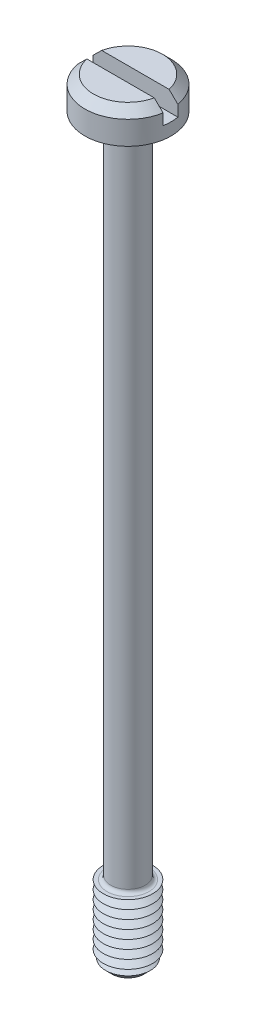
ISO-10303-21;
HEADER;
FILE_DESCRIPTION(('STEP AP214'),'2;1');
FILE_NAME('part.step','',(''),(''),'','','');
FILE_SCHEMA(('AUTOMOTIVE_DESIGN { 1 0 10303 214 1 1 1 1 }'));
ENDSEC;
DATA;
#1=APPLICATION_CONTEXT('core data for automotive mechanical design processes');
#2=APPLICATION_PROTOCOL_DEFINITION('international standard','automotive_design',2000,#1);
#3=PRODUCT_CONTEXT('',#1,'mechanical');
#4=PRODUCT('Part','Part','',(#3));
#5=PRODUCT_RELATED_PRODUCT_CATEGORY('part','',(#4));
#6=PRODUCT_DEFINITION_FORMATION('','',#4);
#7=PRODUCT_DEFINITION_CONTEXT('part definition',#1,'design');
#8=PRODUCT_DEFINITION('design','',#6,#7);
#9=PRODUCT_DEFINITION_SHAPE('','',#8);
#10=(LENGTH_UNIT() NAMED_UNIT(*) SI_UNIT(.MILLI.,.METRE.));
#11=(NAMED_UNIT(*) PLANE_ANGLE_UNIT() SI_UNIT($,.RADIAN.));
#12=(NAMED_UNIT(*) SI_UNIT($,.STERADIAN.) SOLID_ANGLE_UNIT());
#13=UNCERTAINTY_MEASURE_WITH_UNIT(LENGTH_MEASURE(1.E-05),#10,'distance_accuracy_value','');
#14=(GEOMETRIC_REPRESENTATION_CONTEXT(3) GLOBAL_UNCERTAINTY_ASSIGNED_CONTEXT((#13)) GLOBAL_UNIT_ASSIGNED_CONTEXT((#10,
#11,#12)) REPRESENTATION_CONTEXT('',''));
#15=CARTESIAN_POINT('',(0.,0.,0.));
#16=DIRECTION('',(0.,0.,1.));
#17=DIRECTION('',(1.,0.,0.));
#18=AXIS2_PLACEMENT_3D('',#15,#16,#17);
#19=CARTESIAN_POINT('',(0.,2.6,0.));
#20=DIRECTION('',(0.,1.,0.));
#21=DIRECTION('',(0.,0.,1.));
#22=AXIS2_PLACEMENT_3D('',#19,#20,#21);
#23=PLANE('',#22);
#24=DIRECTION('',(-1.,0.,0.));
#25=VECTOR('',#24,1.);
#26=CARTESIAN_POINT('',(3.5,2.6,-0.6));
#27=LINE('',#26,#25);
#28=CARTESIAN_POINT('',(2.73495886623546,2.6,-0.6));
#29=VERTEX_POINT('',#28);
#30=CARTESIAN_POINT('',(-2.73495886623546,2.6,-0.6));
#31=VERTEX_POINT('',#30);
#32=EDGE_CURVE('E110',#29,#31,#27,.T.);
#33=ORIENTED_EDGE('',*,*,#32,.F.);
#34=CARTESIAN_POINT('',(0.,2.6,0.));
#35=DIRECTION('',(0.,1.,0.));
#36=DIRECTION('',(0.,0.,1.));
#37=AXIS2_PLACEMENT_3D('',#34,#35,#36);
#38=CIRCLE('',#37,2.8);
#39=EDGE_CURVE('E113',#29,#31,#38,.T.);
#40=ORIENTED_EDGE('',*,*,#39,.T.);
#41=EDGE_LOOP('',(#33,#40));
#42=FACE_BOUND('',#41,.T.);
#43=ADVANCED_FACE('F39',(#42),#23,.T.);
#44=CARTESIAN_POINT('',(0.,2.6,0.));
#45=DIRECTION('',(0.,-1.,0.));
#46=DIRECTION('',(0.,0.,-1.));
#47=AXIS2_PLACEMENT_3D('',#44,#45,#46);
#48=CONICAL_SURFACE('',#47,2.8,0.785398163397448);
#49=CARTESIAN_POINT('',(7.69779986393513,-2.32114776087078,-0.6));
#50=CARTESIAN_POINT('',(7.42456340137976,-2.0487448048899,-0.6));
#51=CARTESIAN_POINT('',(7.15128998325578,-1.77637887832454,-0.6));
#52=CARTESIAN_POINT('',(6.60460779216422,-1.23176088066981,-0.6));
#53=CARTESIAN_POINT('',(6.33119901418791,-0.959508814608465,-0.6));
#54=CARTESIAN_POINT('',(5.78393918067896,-0.414914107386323,-0.6));
#55=CARTESIAN_POINT('',(5.51008795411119,-0.142571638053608,-0.6));
#56=CARTESIAN_POINT('',(4.96212493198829,0.401829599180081,-0.6));
#57=CARTESIAN_POINT('',(4.68801314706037,0.673888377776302,-0.6));
#58=CARTESIAN_POINT('',(4.15230810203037,1.20471714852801,-0.6));
#59=CARTESIAN_POINT('',(3.89073524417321,1.46350771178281,-0.6));
#60=CARTESIAN_POINT('',(3.49781694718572,1.85115830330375,-0.6));
#61=CARTESIAN_POINT('',(3.36674319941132,1.98029362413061,-0.6));
#62=CARTESIAN_POINT('',(3.10433907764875,2.23830030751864,-0.6));
#63=CARTESIAN_POINT('',(2.97300870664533,2.36717167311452,-0.6));
#64=CARTESIAN_POINT('',(2.71005235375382,2.62445652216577,-0.6));
#65=CARTESIAN_POINT('',(2.57842659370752,2.75287023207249,-0.6));
#66=CARTESIAN_POINT('',(2.31459302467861,3.00911021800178,-0.6));
#67=CARTESIAN_POINT('',(2.1823851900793,3.13693646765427,-0.6));
#68=CARTESIAN_POINT('',(1.91706128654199,3.39159289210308,-0.6));
#69=CARTESIAN_POINT('',(1.78394541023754,3.51842326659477,-0.6));
#70=CARTESIAN_POINT('',(1.5829745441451,3.70728046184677,-0.6));
#71=CARTESIAN_POINT('',(1.51577053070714,3.76999922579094,-0.6));
#72=CARTESIAN_POINT('',(1.38073587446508,3.89475766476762,-0.6));
#73=CARTESIAN_POINT('',(1.31290524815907,3.95679735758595,-0.6));
#74=CARTESIAN_POINT('',(1.20662362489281,4.05253127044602,-0.6));
#75=CARTESIAN_POINT('',(1.16849592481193,4.08658409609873,-0.6));
#76=CARTESIAN_POINT('',(1.09186306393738,4.15427097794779,-0.6));
#77=CARTESIAN_POINT('',(1.05335786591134,4.18790499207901,-0.6));
#78=CARTESIAN_POINT('',(0.975560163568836,4.25487029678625,-0.6));
#79=CARTESIAN_POINT('',(0.93626386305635,4.28819718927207,-0.6));
#80=CARTESIAN_POINT('',(0.857023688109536,4.3540539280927,-0.6));
#81=CARTESIAN_POINT('',(0.817079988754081,4.38658398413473,-0.6));
#82=CARTESIAN_POINT('',(0.73593206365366,4.45080389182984,-0.6));
#83=CARTESIAN_POINT('',(0.694719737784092,4.48248357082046,-0.6));
#84=CARTESIAN_POINT('',(0.611023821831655,4.54411116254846,-0.6));
#85=CARTESIAN_POINT('',(0.568540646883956,4.5740596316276,-0.6));
#86=CARTESIAN_POINT('',(0.482031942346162,4.63104137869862,-0.6));
#87=CARTESIAN_POINT('',(0.438018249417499,4.65809235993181,-0.6));
#88=CARTESIAN_POINT('',(0.347545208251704,4.70764477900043,-0.6));
#89=CARTESIAN_POINT('',(0.301093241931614,4.73015905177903,-0.6));
#90=CARTESIAN_POINT('',(0.216840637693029,4.76288589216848,-0.6));
#91=CARTESIAN_POINT('',(0.179711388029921,4.77476119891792,-0.6));
#92=CARTESIAN_POINT('',(0.104069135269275,4.79214056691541,-0.6));
#93=CARTESIAN_POINT('',(0.0655630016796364,4.79767265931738,-0.6));
#94=CARTESIAN_POINT('',(-0.0121083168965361,4.80113734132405,-0.6));
#95=CARTESIAN_POINT('',(-0.0512762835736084,4.7990121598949,-0.6));
#96=CARTESIAN_POINT('',(-0.128601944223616,4.78758103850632,-0.6));
#97=CARTESIAN_POINT('',(-0.166755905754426,4.77825158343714,-0.6));
#98=CARTESIAN_POINT('',(-0.239985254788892,4.75468984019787,-0.6));
#99=CARTESIAN_POINT('',(-0.275121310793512,4.74063623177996,-0.6));
#100=CARTESIAN_POINT('',(-0.343859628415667,4.70912771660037,-0.6));
#101=CARTESIAN_POINT('',(-0.377459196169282,4.6916670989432,-0.6));
#102=CARTESIAN_POINT('',(-0.443620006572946,4.65431398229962,-0.6));
#103=CARTESIAN_POINT('',(-0.476170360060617,4.63440256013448,-0.6));
#104=CARTESIAN_POINT('',(-0.540208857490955,4.59301144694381,-0.6));
#105=CARTESIAN_POINT('',(-0.57169782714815,4.57153301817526,-0.6));
#106=CARTESIAN_POINT('',(-0.636426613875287,4.52565712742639,-0.6));
#107=CARTESIAN_POINT('',(-0.669598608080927,4.50116466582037,-0.6));
#108=CARTESIAN_POINT('',(-0.735238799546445,4.45125092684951,-0.6));
#109=CARTESIAN_POINT('',(-0.767706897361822,4.42582951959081,-0.6));
#110=CARTESIAN_POINT('',(-0.864340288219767,4.3485376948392,-0.6));
#111=CARTESIAN_POINT('',(-0.927700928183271,4.29566444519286,-0.6));
#112=CARTESIAN_POINT('',(-1.05322030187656,4.18829389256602,-0.6));
#113=CARTESIAN_POINT('',(-1.11537654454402,4.1337937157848,-0.6));
#114=CARTESIAN_POINT('',(-1.23879800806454,4.02383276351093,-0.6));
#115=CARTESIAN_POINT('',(-1.30006349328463,3.96837228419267,-0.6));
#116=CARTESIAN_POINT('',(-1.42182653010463,3.85695373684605,-0.6));
#117=CARTESIAN_POINT('',(-1.48232573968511,3.80099747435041,-0.6));
#118=CARTESIAN_POINT('',(-1.602900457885,3.68862177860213,-0.6));
#119=CARTESIAN_POINT('',(-1.66297593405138,3.63220231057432,-0.6));
#120=CARTESIAN_POINT('',(-1.84259490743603,3.46258196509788,-0.6));
#121=CARTESIAN_POINT('',(-1.96167258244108,3.34888831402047,-0.6));
#122=CARTESIAN_POINT('',(-2.19942862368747,3.12043467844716,-0.6));
#123=CARTESIAN_POINT('',(-2.31810499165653,3.00567262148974,-0.6));
#124=CARTESIAN_POINT('',(-2.55498513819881,2.77566147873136,-0.6));
#125=CARTESIAN_POINT('',(-2.67318891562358,2.66041239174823,-0.6));
#126=CARTESIAN_POINT('',(-3.02733776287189,2.31418176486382,-0.6));
#127=CARTESIAN_POINT('',(-3.26281496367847,2.08272206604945,-0.6));
#128=CARTESIAN_POINT('',(-3.7332660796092,1.61902814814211,-0.6));
#129=CARTESIAN_POINT('',(-3.96823963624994,1.38679356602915,-0.6));
#130=CARTESIAN_POINT('',(-4.43780370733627,0.921942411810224,-0.6));
#131=CARTESIAN_POINT('',(-4.67239422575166,0.689325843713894,-0.6));
#132=CARTESIAN_POINT('',(-5.13982382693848,0.225350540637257,-0.6));
#133=CARTESIAN_POINT('',(-5.37266445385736,-0.00600663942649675,-0.6));
#134=CARTESIAN_POINT('',(-5.83818541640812,-0.468883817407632,-0.6));
#135=CARTESIAN_POINT('',(-6.07086575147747,-0.700403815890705,-0.6));
#136=CARTESIAN_POINT('',(-6.53596926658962,-1.16341429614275,-0.6));
#137=CARTESIAN_POINT('',(-6.76839251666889,-1.39490470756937,-0.6));
#138=CARTESIAN_POINT('',(-7.23315324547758,-1.85796986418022,-0.6));
#139=CARTESIAN_POINT('',(-7.46549072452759,-2.08954460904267,-0.6));
#140=CARTESIAN_POINT('',(-7.69779986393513,-2.32114776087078,-0.6));
#141=B_SPLINE_CURVE_WITH_KNOTS('',3,(#49,#50,#51,#52,#53,#54,#55,#56,#57,#58,#59,#60,#61,#62,
#63,#64,#65,#66,#67,#68,#69,#70,#71,#72,#73,#74,#75,#76,#77,#78,#79,#80,#81,#82,#83,#84,#85,#86,
#87,#88,#89,#90,#91,#92,#93,#94,#95,#96,#97,#98,#99,#100,#101,#102,#103,#104,#105,#106,#107,
#108,#109,#110,#111,#112,#113,#114,#115,#116,#117,#118,#119,#120,#121,#122,#123,#124,#125,#126,
#127,#128,#129,#130,#131,#132,#133,#134,#135,#136,#137,#138,#139,#140),.UNSPECIFIED.,.F.,.F.,(4,
2,2,2,2,2,2,2,2,2,2,2,2,2,2,2,2,2,2,2,2,2,2,2,2,2,2,2,2,2,2,2,2,2,2,2,2,2,2,2,2,2,2,2,2,4),(0.,
1.15747738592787,2.31500139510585,3.47365747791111,4.63226817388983,5.73614050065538,
6.28814234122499,6.84013779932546,7.39180548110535,7.94349768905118,8.49507629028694,
8.77084567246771,9.04660781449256,9.19996738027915,9.35334222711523,9.50791164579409,
9.66243993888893,9.81835637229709,9.9742224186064,10.1290741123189,10.2834813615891,
10.4000294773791,10.5160605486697,10.6329688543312,10.7502603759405,10.8635386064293,
10.9770083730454,11.0914168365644,11.205734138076,11.3294140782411,11.4531113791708,
11.7006314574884,11.9486181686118,12.1965297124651,12.4437540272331,12.6909970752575,
13.184904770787,13.6801705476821,14.1754375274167,15.1659939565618,16.1571087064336,
17.1482131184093,18.1329303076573,19.1176509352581,20.1017623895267,21.0858701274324),.UNSPECIFIED.);
#142=CARTESIAN_POINT('',(3.44818792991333,1.9,-0.6));
#143=VERTEX_POINT('',#142);
#144=EDGE_CURVE('E259',#143,#29,#141,.T.);
#145=ORIENTED_EDGE('',*,*,#144,.F.);
#146=CARTESIAN_POINT('',(0.,1.9,0.));
#147=DIRECTION('',(0.,1.,0.));
#148=DIRECTION('',(0.,0.,1.));
#149=AXIS2_PLACEMENT_3D('',#146,#147,#148);
#150=CIRCLE('',#149,3.5);
#151=CARTESIAN_POINT('',(-3.44818792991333,1.9,-0.6));
#152=VERTEX_POINT('',#151);
#153=EDGE_CURVE('E127',#152,#143,#150,.F.);
#154=ORIENTED_EDGE('',*,*,#153,.F.);
#155=EDGE_CURVE('E102',#31,#152,#141,.T.);
#156=ORIENTED_EDGE('',*,*,#155,.F.);
#157=ORIENTED_EDGE('',*,*,#39,.F.);
#158=EDGE_LOOP('',(#145,#154,#156,#157));
#159=FACE_BOUND('',#158,.T.);
#160=ADVANCED_FACE('F221',(#159),#48,.T.);
#161=CARTESIAN_POINT('',(0.,-60.,0.));
#162=DIRECTION('',(0.,1.,0.));
#163=DIRECTION('',(0.,0.,1.));
#164=AXIS2_PLACEMENT_3D('',#161,#162,#163);
#165=CYLINDRICAL_SURFACE('',#164,1.4);
#166=CARTESIAN_POINT('',(0.,-53.7,0.));
#167=DIRECTION('',(0.,-1.,0.));
#168=DIRECTION('',(0.,0.,-1.));
#169=AXIS2_PLACEMENT_3D('',#166,#167,#168);
#170=CIRCLE('',#169,1.4);
#171=CARTESIAN_POINT('',(0.,-53.7,-1.4));
#172=VERTEX_POINT('',#171);
#173=EDGE_CURVE('E122',#172,#172,#170,.F.);
#174=ORIENTED_EDGE('',*,*,#173,.T.);
#175=EDGE_LOOP('',(#174));
#176=FACE_BOUND('',#175,.T.);
#177=CARTESIAN_POINT('',(0.,-0.300000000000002,0.));
#178=DIRECTION('',(0.,1.,0.));
#179=DIRECTION('',(0.,0.,1.));
#180=AXIS2_PLACEMENT_3D('',#177,#178,#179);
#181=CIRCLE('',#180,1.4);
#182=CARTESIAN_POINT('',(0.,-0.300000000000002,1.4));
#183=VERTEX_POINT('',#182);
#184=EDGE_CURVE('E366',#183,#183,#181,.F.);
#185=ORIENTED_EDGE('',*,*,#184,.T.);
#186=EDGE_LOOP('',(#185));
#187=FACE_BOUND('',#186,.T.);
#188=ADVANCED_FACE('F217',(#176,#187),#165,.T.);
#189=CARTESIAN_POINT('',(0.,2.6,0.));
#190=DIRECTION('',(0.,-1.,0.));
#191=DIRECTION('',(0.,0.,-1.));
#192=AXIS2_PLACEMENT_3D('',#189,#190,#191);
#193=CYLINDRICAL_SURFACE('',#192,3.5);
#194=ORIENTED_EDGE('',*,*,#153,.T.);
#195=DIRECTION('',(0.,-1.,0.));
#196=VECTOR('',#195,1.);
#197=CARTESIAN_POINT('',(3.44818792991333,2.6,-0.6));
#198=LINE('',#197,#196);
#199=CARTESIAN_POINT('',(3.44818792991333,1.,-0.6));
#200=VERTEX_POINT('',#199);
#201=EDGE_CURVE('E64',#143,#200,#198,.T.);
#202=ORIENTED_EDGE('',*,*,#201,.T.);
#203=CARTESIAN_POINT('',(0.,1.,0.));
#204=DIRECTION('',(0.,1.,0.));
#205=DIRECTION('',(0.,0.,1.));
#206=AXIS2_PLACEMENT_3D('',#203,#204,#205);
#207=CIRCLE('',#206,3.5);
#208=CARTESIAN_POINT('',(3.44818792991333,1.,0.6));
#209=VERTEX_POINT('',#208);
#210=EDGE_CURVE('E11',#209,#200,#207,.T.);
#211=ORIENTED_EDGE('',*,*,#210,.F.);
#212=DIRECTION('',(0.,-1.,0.));
#213=VECTOR('',#212,1.);
#214=CARTESIAN_POINT('',(3.44818792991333,2.6,0.6));
#215=LINE('',#214,#213);
#216=CARTESIAN_POINT('',(3.44818792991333,1.9,0.6));
#217=VERTEX_POINT('',#216);
#218=EDGE_CURVE('E277',#209,#217,#215,.F.);
#219=ORIENTED_EDGE('',*,*,#218,.T.);
#220=CARTESIAN_POINT('',(-3.44818792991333,1.9,0.6));
#221=VERTEX_POINT('',#220);
#222=EDGE_CURVE('E119',#217,#221,#150,.F.);
#223=ORIENTED_EDGE('',*,*,#222,.T.);
#224=DIRECTION('',(0.,-1.,0.));
#225=VECTOR('',#224,1.);
#226=CARTESIAN_POINT('',(-3.44818792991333,2.6,0.6));
#227=LINE('',#226,#225);
#228=CARTESIAN_POINT('',(-3.44818792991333,1.,0.6));
#229=VERTEX_POINT('',#228);
#230=EDGE_CURVE('E96',#221,#229,#227,.T.);
#231=ORIENTED_EDGE('',*,*,#230,.T.);
#232=CARTESIAN_POINT('',(-3.44818792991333,1.,-0.6));
#233=VERTEX_POINT('',#232);
#234=EDGE_CURVE('E44',#233,#229,#207,.T.);
#235=ORIENTED_EDGE('',*,*,#234,.F.);
#236=DIRECTION('',(0.,-1.,0.));
#237=VECTOR('',#236,1.);
#238=CARTESIAN_POINT('',(-3.44818792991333,2.6,-0.6));
#239=LINE('',#238,#237);
#240=EDGE_CURVE('E281',#233,#152,#239,.F.);
#241=ORIENTED_EDGE('',*,*,#240,.T.);
#242=EDGE_LOOP('',(#194,#202,#211,#219,#223,#231,#235,#241));
#243=FACE_BOUND('',#242,.T.);
#244=CARTESIAN_POINT('',(0.,0.,0.));
#245=DIRECTION('',(0.,1.,0.));
#246=DIRECTION('',(0.,0.,1.));
#247=AXIS2_PLACEMENT_3D('',#244,#245,#246);
#248=CIRCLE('',#247,3.5);
#249=CARTESIAN_POINT('',(0.,0.,3.5));
#250=VERTEX_POINT('',#249);
#251=EDGE_CURVE('E352',#250,#250,#248,.T.);
#252=ORIENTED_EDGE('',*,*,#251,.T.);
#253=EDGE_LOOP('',(#252));
#254=FACE_BOUND('',#253,.T.);
#255=ADVANCED_FACE('F220',(#243,#254),#193,.T.);
#256=DIRECTION('',(1.,0.,0.));
#257=VECTOR('',#256,1.);
#258=CARTESIAN_POINT('',(3.5,2.6,0.6));
#259=LINE('',#258,#257);
#260=CARTESIAN_POINT('',(-2.73495886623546,2.6,0.6));
#261=VERTEX_POINT('',#260);
#262=CARTESIAN_POINT('',(2.73495886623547,2.6,0.6));
#263=VERTEX_POINT('',#262);
#264=EDGE_CURVE('E56',#261,#263,#259,.T.);
#265=ORIENTED_EDGE('',*,*,#264,.F.);
#266=EDGE_CURVE('E108',#261,#263,#38,.T.);
#267=ORIENTED_EDGE('',*,*,#266,.T.);
#268=EDGE_LOOP('',(#265,#267));
#269=FACE_BOUND('',#268,.T.);
#270=ADVANCED_FACE('F107',(#269),#23,.T.);
#271=CARTESIAN_POINT('',(0.,0.,0.));
#272=DIRECTION('',(0.,1.,0.));
#273=DIRECTION('',(0.,0.,1.));
#274=AXIS2_PLACEMENT_3D('',#271,#272,#273);
#275=PLANE('',#274);
#276=CARTESIAN_POINT('',(0.,0.,0.));
#277=DIRECTION('',(0.,1.,0.));
#278=DIRECTION('',(0.,0.,1.));
#279=AXIS2_PLACEMENT_3D('',#276,#277,#278);
#280=CIRCLE('',#279,1.7);
#281=CARTESIAN_POINT('',(0.,0.,1.7));
#282=VERTEX_POINT('',#281);
#283=EDGE_CURVE('E114',#282,#282,#280,.T.);
#284=ORIENTED_EDGE('',*,*,#283,.T.);
#285=EDGE_LOOP('',(#284));
#286=FACE_BOUND('',#285,.T.);
#287=ORIENTED_EDGE('',*,*,#251,.F.);
#288=EDGE_LOOP('',(#287));
#289=FACE_BOUND('',#288,.T.);
#290=ADVANCED_FACE('F211',(#286,#289),#275,.F.);
#291=CARTESIAN_POINT('',(0.,-54.,0.));
#292=DIRECTION('',(0.,-1.,0.));
#293=DIRECTION('',(0.,0.,-1.));
#294=AXIS2_PLACEMENT_3D('',#291,#292,#293);
#295=PLANE('',#294);
#296=CARTESIAN_POINT('',(0.,-54.,0.));
#297=DIRECTION('',(0.,-1.,0.));
#298=DIRECTION('',(0.,0.,-1.));
#299=AXIS2_PLACEMENT_3D('',#296,#297,#298);
#300=CIRCLE('',#299,1.7);
#301=CARTESIAN_POINT('',(0.,-54.,-1.7));
#302=VERTEX_POINT('',#301);
#303=EDGE_CURVE('E360',#302,#302,#300,.T.);
#304=ORIENTED_EDGE('',*,*,#303,.T.);
#305=EDGE_LOOP('',(#304));
#306=FACE_BOUND('',#305,.T.);
#307=CARTESIAN_POINT('',(0.,-54.,0.));
#308=DIRECTION('',(0.,1.,0.));
#309=DIRECTION('',(0.,0.,1.));
#310=AXIS2_PLACEMENT_3D('',#307,#308,#309);
#311=CIRCLE('',#310,2.);
#312=CARTESIAN_POINT('',(0.,-54.,2.));
#313=VERTEX_POINT('',#312);
#314=EDGE_CURVE('E348',#313,#313,#311,.T.);
#315=ORIENTED_EDGE('',*,*,#314,.T.);
#316=EDGE_LOOP('',(#315));
#317=FACE_BOUND('',#316,.T.);
#318=ADVANCED_FACE('F207',(#306,#317),#295,.F.);
#319=CARTESIAN_POINT('',(0.,-54.35,0.));
#320=DIRECTION('',(0.,1.,0.));
#321=DIRECTION('',(0.,0.,1.));
#322=AXIS2_PLACEMENT_3D('',#319,#320,#321);
#323=CONICAL_SURFACE('',#322,1.39378221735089,1.0471975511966);
#324=ORIENTED_EDGE('',*,*,#314,.F.);
#325=EDGE_LOOP('',(#324));
#326=FACE_BOUND('',#325,.T.);
#327=CARTESIAN_POINT('',(0.,-54.35,0.));
#328=DIRECTION('',(0.,1.,0.));
#329=DIRECTION('',(0.,0.,1.));
#330=AXIS2_PLACEMENT_3D('',#327,#328,#329);
#331=CIRCLE('',#330,1.39378221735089);
#332=CARTESIAN_POINT('',(0.,-54.35,1.39378221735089));
#333=VERTEX_POINT('',#332);
#334=EDGE_CURVE('E345',#333,#333,#331,.T.);
#335=ORIENTED_EDGE('',*,*,#334,.T.);
#336=EDGE_LOOP('',(#335));
#337=FACE_BOUND('',#336,.T.);
#338=ADVANCED_FACE('F203',(#326,#337),#323,.T.);
#339=CARTESIAN_POINT('',(0.,-54.7,0.));
#340=DIRECTION('',(0.,-1.,0.));
#341=DIRECTION('',(0.,0.,-1.));
#342=AXIS2_PLACEMENT_3D('',#339,#340,#341);
#343=CONICAL_SURFACE('',#342,2.,1.04719755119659);
#344=ORIENTED_EDGE('',*,*,#334,.F.);
#345=EDGE_LOOP('',(#344));
#346=FACE_BOUND('',#345,.T.);
#347=CARTESIAN_POINT('',(0.,-54.7,0.));
#348=DIRECTION('',(0.,1.,0.));
#349=DIRECTION('',(0.,0.,1.));
#350=AXIS2_PLACEMENT_3D('',#347,#348,#349);
#351=CIRCLE('',#350,2.);
#352=CARTESIAN_POINT('',(0.,-54.7,2.));
#353=VERTEX_POINT('',#352);
#354=EDGE_CURVE('E341',#353,#353,#351,.T.);
#355=ORIENTED_EDGE('',*,*,#354,.T.);
#356=EDGE_LOOP('',(#355));
#357=FACE_BOUND('',#356,.T.);
#358=ADVANCED_FACE('F199',(#346,#357),#343,.T.);
#359=CARTESIAN_POINT('',(0.,-55.05,0.));
#360=DIRECTION('',(0.,1.,0.));
#361=DIRECTION('',(0.,0.,1.));
#362=AXIS2_PLACEMENT_3D('',#359,#360,#361);
#363=CONICAL_SURFACE('',#362,1.39378221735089,1.0471975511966);
#364=ORIENTED_EDGE('',*,*,#354,.F.);
#365=EDGE_LOOP('',(#364));
#366=FACE_BOUND('',#365,.T.);
#367=CARTESIAN_POINT('',(0.,-55.05,0.));
#368=DIRECTION('',(0.,1.,0.));
#369=DIRECTION('',(0.,0.,1.));
#370=AXIS2_PLACEMENT_3D('',#367,#368,#369);
#371=CIRCLE('',#370,1.39378221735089);
#372=CARTESIAN_POINT('',(0.,-55.05,1.39378221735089));
#373=VERTEX_POINT('',#372);
#374=EDGE_CURVE('E337',#373,#373,#371,.T.);
#375=ORIENTED_EDGE('',*,*,#374,.T.);
#376=EDGE_LOOP('',(#375));
#377=FACE_BOUND('',#376,.T.);
#378=ADVANCED_FACE('F195',(#366,#377),#363,.T.);
#379=CARTESIAN_POINT('',(0.,-55.4,0.));
#380=DIRECTION('',(0.,-1.,0.));
#381=DIRECTION('',(0.,0.,-1.));
#382=AXIS2_PLACEMENT_3D('',#379,#380,#381);
#383=CONICAL_SURFACE('',#382,2.,1.04719755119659);
#384=ORIENTED_EDGE('',*,*,#374,.F.);
#385=EDGE_LOOP('',(#384));
#386=FACE_BOUND('',#385,.T.);
#387=CARTESIAN_POINT('',(0.,-55.4,0.));
#388=DIRECTION('',(0.,1.,0.));
#389=DIRECTION('',(0.,0.,1.));
#390=AXIS2_PLACEMENT_3D('',#387,#388,#389);
#391=CIRCLE('',#390,2.);
#392=CARTESIAN_POINT('',(0.,-55.4,2.));
#393=VERTEX_POINT('',#392);
#394=EDGE_CURVE('E333',#393,#393,#391,.T.);
#395=ORIENTED_EDGE('',*,*,#394,.T.);
#396=EDGE_LOOP('',(#395));
#397=FACE_BOUND('',#396,.T.);
#398=ADVANCED_FACE('F191',(#386,#397),#383,.T.);
#399=CARTESIAN_POINT('',(0.,-55.75,0.));
#400=DIRECTION('',(0.,1.,0.));
#401=DIRECTION('',(0.,0.,1.));
#402=AXIS2_PLACEMENT_3D('',#399,#400,#401);
#403=CONICAL_SURFACE('',#402,1.39378221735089,1.0471975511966);
#404=ORIENTED_EDGE('',*,*,#394,.F.);
#405=EDGE_LOOP('',(#404));
#406=FACE_BOUND('',#405,.T.);
#407=CARTESIAN_POINT('',(0.,-55.75,0.));
#408=DIRECTION('',(0.,1.,0.));
#409=DIRECTION('',(0.,0.,1.));
#410=AXIS2_PLACEMENT_3D('',#407,#408,#409);
#411=CIRCLE('',#410,1.39378221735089);
#412=CARTESIAN_POINT('',(0.,-55.75,1.39378221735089));
#413=VERTEX_POINT('',#412);
#414=EDGE_CURVE('E329',#413,#413,#411,.T.);
#415=ORIENTED_EDGE('',*,*,#414,.T.);
#416=EDGE_LOOP('',(#415));
#417=FACE_BOUND('',#416,.T.);
#418=ADVANCED_FACE('F187',(#406,#417),#403,.T.);
#419=CARTESIAN_POINT('',(0.,-56.1,0.));
#420=DIRECTION('',(0.,-1.,0.));
#421=DIRECTION('',(0.,0.,-1.));
#422=AXIS2_PLACEMENT_3D('',#419,#420,#421);
#423=CONICAL_SURFACE('',#422,2.,1.04719755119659);
#424=ORIENTED_EDGE('',*,*,#414,.F.);
#425=EDGE_LOOP('',(#424));
#426=FACE_BOUND('',#425,.T.);
#427=CARTESIAN_POINT('',(0.,-56.1,0.));
#428=DIRECTION('',(0.,1.,0.));
#429=DIRECTION('',(0.,0.,1.));
#430=AXIS2_PLACEMENT_3D('',#427,#428,#429);
#431=CIRCLE('',#430,2.);
#432=CARTESIAN_POINT('',(0.,-56.1,2.));
#433=VERTEX_POINT('',#432);
#434=EDGE_CURVE('E326',#433,#433,#431,.T.);
#435=ORIENTED_EDGE('',*,*,#434,.T.);
#436=EDGE_LOOP('',(#435));
#437=FACE_BOUND('',#436,.T.);
#438=ADVANCED_FACE('F183',(#426,#437),#423,.T.);
#439=CARTESIAN_POINT('',(0.,-56.45,0.));
#440=DIRECTION('',(0.,1.,0.));
#441=DIRECTION('',(0.,0.,1.));
#442=AXIS2_PLACEMENT_3D('',#439,#440,#441);
#443=CONICAL_SURFACE('',#442,1.39378221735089,1.0471975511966);
#444=ORIENTED_EDGE('',*,*,#434,.F.);
#445=EDGE_LOOP('',(#444));
#446=FACE_BOUND('',#445,.T.);
#447=CARTESIAN_POINT('',(0.,-56.45,0.));
#448=DIRECTION('',(0.,1.,0.));
#449=DIRECTION('',(0.,0.,1.));
#450=AXIS2_PLACEMENT_3D('',#447,#448,#449);
#451=CIRCLE('',#450,1.39378221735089);
#452=CARTESIAN_POINT('',(0.,-56.45,1.39378221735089));
#453=VERTEX_POINT('',#452);
#454=EDGE_CURVE('E323',#453,#453,#451,.T.);
#455=ORIENTED_EDGE('',*,*,#454,.T.);
#456=EDGE_LOOP('',(#455));
#457=FACE_BOUND('',#456,.T.);
#458=ADVANCED_FACE('F179',(#446,#457),#443,.T.);
#459=CARTESIAN_POINT('',(0.,-56.8,0.));
#460=DIRECTION('',(0.,-1.,0.));
#461=DIRECTION('',(0.,0.,-1.));
#462=AXIS2_PLACEMENT_3D('',#459,#460,#461);
#463=CONICAL_SURFACE('',#462,2.,1.04719755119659);
#464=ORIENTED_EDGE('',*,*,#454,.F.);
#465=EDGE_LOOP('',(#464));
#466=FACE_BOUND('',#465,.T.);
#467=CARTESIAN_POINT('',(0.,-56.8,0.));
#468=DIRECTION('',(0.,1.,0.));
#469=DIRECTION('',(0.,0.,1.));
#470=AXIS2_PLACEMENT_3D('',#467,#468,#469);
#471=CIRCLE('',#470,2.);
#472=CARTESIAN_POINT('',(0.,-56.8,2.));
#473=VERTEX_POINT('',#472);
#474=EDGE_CURVE('E319',#473,#473,#471,.T.);
#475=ORIENTED_EDGE('',*,*,#474,.T.);
#476=EDGE_LOOP('',(#475));
#477=FACE_BOUND('',#476,.T.);
#478=ADVANCED_FACE('F175',(#466,#477),#463,.T.);
#479=CARTESIAN_POINT('',(0.,-57.15,0.));
#480=DIRECTION('',(0.,1.,0.));
#481=DIRECTION('',(0.,0.,1.));
#482=AXIS2_PLACEMENT_3D('',#479,#480,#481);
#483=CONICAL_SURFACE('',#482,1.39378221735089,1.0471975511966);
#484=ORIENTED_EDGE('',*,*,#474,.F.);
#485=EDGE_LOOP('',(#484));
#486=FACE_BOUND('',#485,.T.);
#487=CARTESIAN_POINT('',(0.,-57.15,0.));
#488=DIRECTION('',(0.,1.,0.));
#489=DIRECTION('',(0.,0.,1.));
#490=AXIS2_PLACEMENT_3D('',#487,#488,#489);
#491=CIRCLE('',#490,1.39378221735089);
#492=CARTESIAN_POINT('',(0.,-57.15,1.39378221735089));
#493=VERTEX_POINT('',#492);
#494=EDGE_CURVE('E315',#493,#493,#491,.T.);
#495=ORIENTED_EDGE('',*,*,#494,.T.);
#496=EDGE_LOOP('',(#495));
#497=FACE_BOUND('',#496,.T.);
#498=ADVANCED_FACE('F171',(#486,#497),#483,.T.);
#499=CARTESIAN_POINT('',(0.,-57.5,0.));
#500=DIRECTION('',(0.,-1.,0.));
#501=DIRECTION('',(0.,0.,-1.));
#502=AXIS2_PLACEMENT_3D('',#499,#500,#501);
#503=CONICAL_SURFACE('',#502,2.,1.04719755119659);
#504=ORIENTED_EDGE('',*,*,#494,.F.);
#505=EDGE_LOOP('',(#504));
#506=FACE_BOUND('',#505,.T.);
#507=CARTESIAN_POINT('',(0.,-57.5,0.));
#508=DIRECTION('',(0.,1.,0.));
#509=DIRECTION('',(0.,0.,1.));
#510=AXIS2_PLACEMENT_3D('',#507,#508,#509);
#511=CIRCLE('',#510,2.);
#512=CARTESIAN_POINT('',(0.,-57.5,2.));
#513=VERTEX_POINT('',#512);
#514=EDGE_CURVE('E311',#513,#513,#511,.T.);
#515=ORIENTED_EDGE('',*,*,#514,.T.);
#516=EDGE_LOOP('',(#515));
#517=FACE_BOUND('',#516,.T.);
#518=ADVANCED_FACE('F167',(#506,#517),#503,.T.);
#519=CARTESIAN_POINT('',(0.,-57.85,0.));
#520=DIRECTION('',(0.,1.,0.));
#521=DIRECTION('',(0.,0.,1.));
#522=AXIS2_PLACEMENT_3D('',#519,#520,#521);
#523=CONICAL_SURFACE('',#522,1.39378221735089,1.0471975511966);
#524=ORIENTED_EDGE('',*,*,#514,.F.);
#525=EDGE_LOOP('',(#524));
#526=FACE_BOUND('',#525,.T.);
#527=CARTESIAN_POINT('',(0.,-57.85,0.));
#528=DIRECTION('',(0.,1.,0.));
#529=DIRECTION('',(0.,0.,1.));
#530=AXIS2_PLACEMENT_3D('',#527,#528,#529);
#531=CIRCLE('',#530,1.39378221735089);
#532=CARTESIAN_POINT('',(0.,-57.85,1.39378221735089));
#533=VERTEX_POINT('',#532);
#534=EDGE_CURVE('E307',#533,#533,#531,.T.);
#535=ORIENTED_EDGE('',*,*,#534,.T.);
#536=EDGE_LOOP('',(#535));
#537=FACE_BOUND('',#536,.T.);
#538=ADVANCED_FACE('F163',(#526,#537),#523,.T.);
#539=CARTESIAN_POINT('',(0.,-58.2,0.));
#540=DIRECTION('',(0.,-1.,0.));
#541=DIRECTION('',(0.,0.,-1.));
#542=AXIS2_PLACEMENT_3D('',#539,#540,#541);
#543=CONICAL_SURFACE('',#542,2.,1.04719755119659);
#544=ORIENTED_EDGE('',*,*,#534,.F.);
#545=EDGE_LOOP('',(#544));
#546=FACE_BOUND('',#545,.T.);
#547=CARTESIAN_POINT('',(0.,-58.2,0.));
#548=DIRECTION('',(0.,1.,0.));
#549=DIRECTION('',(0.,0.,1.));
#550=AXIS2_PLACEMENT_3D('',#547,#548,#549);
#551=CIRCLE('',#550,2.);
#552=CARTESIAN_POINT('',(0.,-58.2,2.));
#553=VERTEX_POINT('',#552);
#554=EDGE_CURVE('E303',#553,#553,#551,.T.);
#555=ORIENTED_EDGE('',*,*,#554,.T.);
#556=EDGE_LOOP('',(#555));
#557=FACE_BOUND('',#556,.T.);
#558=ADVANCED_FACE('F159',(#546,#557),#543,.T.);
#559=CARTESIAN_POINT('',(0.,-58.55,0.));
#560=DIRECTION('',(0.,1.,0.));
#561=DIRECTION('',(0.,0.,1.));
#562=AXIS2_PLACEMENT_3D('',#559,#560,#561);
#563=CONICAL_SURFACE('',#562,1.39378221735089,1.0471975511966);
#564=ORIENTED_EDGE('',*,*,#554,.F.);
#565=EDGE_LOOP('',(#564));
#566=FACE_BOUND('',#565,.T.);
#567=CARTESIAN_POINT('',(0.,-58.55,0.));
#568=DIRECTION('',(0.,1.,0.));
#569=DIRECTION('',(0.,0.,1.));
#570=AXIS2_PLACEMENT_3D('',#567,#568,#569);
#571=CIRCLE('',#570,1.39378221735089);
#572=CARTESIAN_POINT('',(0.,-58.55,1.39378221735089));
#573=VERTEX_POINT('',#572);
#574=EDGE_CURVE('E300',#573,#573,#571,.T.);
#575=ORIENTED_EDGE('',*,*,#574,.T.);
#576=EDGE_LOOP('',(#575));
#577=FACE_BOUND('',#576,.T.);
#578=ADVANCED_FACE('F155',(#566,#577),#563,.T.);
#579=CARTESIAN_POINT('',(0.,-58.9,0.));
#580=DIRECTION('',(0.,-1.,0.));
#581=DIRECTION('',(0.,0.,-1.));
#582=AXIS2_PLACEMENT_3D('',#579,#580,#581);
#583=CONICAL_SURFACE('',#582,2.,1.04719755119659);
#584=ORIENTED_EDGE('',*,*,#574,.F.);
#585=EDGE_LOOP('',(#584));
#586=FACE_BOUND('',#585,.T.);
#587=CARTESIAN_POINT('',(0.,-58.9,0.));
#588=DIRECTION('',(0.,1.,0.));
#589=DIRECTION('',(0.,0.,1.));
#590=AXIS2_PLACEMENT_3D('',#587,#588,#589);
#591=CIRCLE('',#590,2.);
#592=CARTESIAN_POINT('',(0.,-58.9,2.));
#593=VERTEX_POINT('',#592);
#594=EDGE_CURVE('E296',#593,#593,#591,.T.);
#595=ORIENTED_EDGE('',*,*,#594,.T.);
#596=EDGE_LOOP('',(#595));
#597=FACE_BOUND('',#596,.T.);
#598=ADVANCED_FACE('F151',(#586,#597),#583,.T.);
#599=CARTESIAN_POINT('',(0.,-59.25,0.));
#600=DIRECTION('',(0.,1.,0.));
#601=DIRECTION('',(0.,0.,1.));
#602=AXIS2_PLACEMENT_3D('',#599,#600,#601);
#603=CONICAL_SURFACE('',#602,1.39378221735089,1.0471975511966);
#604=ORIENTED_EDGE('',*,*,#594,.F.);
#605=EDGE_LOOP('',(#604));
#606=FACE_BOUND('',#605,.T.);
#607=CARTESIAN_POINT('',(0.,-59.25,0.));
#608=DIRECTION('',(0.,1.,0.));
#609=DIRECTION('',(0.,0.,1.));
#610=AXIS2_PLACEMENT_3D('',#607,#608,#609);
#611=CIRCLE('',#610,1.39378221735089);
#612=CARTESIAN_POINT('',(0.,-59.25,1.39378221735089));
#613=VERTEX_POINT('',#612);
#614=EDGE_CURVE('E292',#613,#613,#611,.T.);
#615=ORIENTED_EDGE('',*,*,#614,.T.);
#616=EDGE_LOOP('',(#615));
#617=FACE_BOUND('',#616,.T.);
#618=ADVANCED_FACE('F147',(#606,#617),#603,.T.);
#619=CARTESIAN_POINT('',(0.,-59.6,0.));
#620=DIRECTION('',(0.,-1.,0.));
#621=DIRECTION('',(0.,0.,-1.));
#622=AXIS2_PLACEMENT_3D('',#619,#620,#621);
#623=CONICAL_SURFACE('',#622,2.,1.04719755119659);
#624=CARTESIAN_POINT('',(0.,-59.4901923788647,0.));
#625=DIRECTION('',(0.,-1.,0.));
#626=DIRECTION('',(0.,0.,-1.));
#627=AXIS2_PLACEMENT_3D('',#624,#625,#626);
#628=CIRCLE('',#627,1.80980762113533);
#629=CARTESIAN_POINT('',(0.,-59.4901923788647,-1.80980762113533));
#630=VERTEX_POINT('',#629);
#631=EDGE_CURVE('E299',#630,#630,#628,.F.);
#632=ORIENTED_EDGE('',*,*,#631,.T.);
#633=EDGE_LOOP('',(#632));
#634=FACE_BOUND('',#633,.T.);
#635=ORIENTED_EDGE('',*,*,#614,.F.);
#636=EDGE_LOOP('',(#635));
#637=FACE_BOUND('',#636,.T.);
#638=ADVANCED_FACE('F143',(#634,#637),#623,.T.);
#639=CARTESIAN_POINT('',(0.,-60.,0.));
#640=DIRECTION('',(0.,-1.,0.));
#641=DIRECTION('',(0.,0.,-1.));
#642=AXIS2_PLACEMENT_3D('',#639,#640,#641);
#643=PLANE('',#642);
#644=CARTESIAN_POINT('',(0.,-60.,0.));
#645=DIRECTION('',(0.,-1.,0.));
#646=DIRECTION('',(0.,0.,-1.));
#647=AXIS2_PLACEMENT_3D('',#644,#645,#646);
#648=CIRCLE('',#647,1.3);
#649=CARTESIAN_POINT('',(0.,-60.,-1.3));
#650=VERTEX_POINT('',#649);
#651=EDGE_CURVE('E356',#650,#650,#648,.T.);
#652=ORIENTED_EDGE('',*,*,#651,.T.);
#653=EDGE_LOOP('',(#652));
#654=FACE_BOUND('',#653,.T.);
#655=ADVANCED_FACE('F146',(#654),#643,.T.);
#656=CARTESIAN_POINT('',(0.,-60.,0.));
#657=DIRECTION('',(0.,1.,0.));
#658=DIRECTION('',(0.,0.,1.));
#659=AXIS2_PLACEMENT_3D('',#656,#657,#658);
#660=CONICAL_SURFACE('',#659,1.3,0.785398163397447);
#661=ORIENTED_EDGE('',*,*,#631,.F.);
#662=EDGE_LOOP('',(#661));
#663=FACE_BOUND('',#662,.T.);
#664=ORIENTED_EDGE('',*,*,#651,.F.);
#665=EDGE_LOOP('',(#664));
#666=FACE_BOUND('',#665,.T.);
#667=ADVANCED_FACE('F215',(#663,#666),#660,.T.);
#668=CARTESIAN_POINT('',(0.,-53.7,0.));
#669=DIRECTION('',(0.,-1.,0.));
#670=DIRECTION('',(0.,0.,-1.));
#671=AXIS2_PLACEMENT_3D('',#668,#669,#670);
#672=TOROIDAL_SURFACE('',#671,1.7,0.3);
#673=ORIENTED_EDGE('',*,*,#173,.F.);
#674=EDGE_LOOP('',(#673));
#675=FACE_BOUND('',#674,.T.);
#676=ORIENTED_EDGE('',*,*,#303,.F.);
#677=EDGE_LOOP('',(#676));
#678=FACE_BOUND('',#677,.T.);
#679=ADVANCED_FACE('F233',(#675,#678),#672,.F.);
#680=CARTESIAN_POINT('',(0.,-0.300000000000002,0.));
#681=DIRECTION('',(0.,1.,0.));
#682=DIRECTION('',(0.,0.,1.));
#683=AXIS2_PLACEMENT_3D('',#680,#681,#682);
#684=TOROIDAL_SURFACE('',#683,1.7,0.3);
#685=ORIENTED_EDGE('',*,*,#283,.F.);
#686=EDGE_LOOP('',(#685));
#687=FACE_BOUND('',#686,.T.);
#688=ORIENTED_EDGE('',*,*,#184,.F.);
#689=EDGE_LOOP('',(#688));
#690=FACE_BOUND('',#689,.T.);
#691=ADVANCED_FACE('F236',(#687,#690),#684,.F.);
#692=CARTESIAN_POINT('',(-7.69779986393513,-2.32114776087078,0.6));
#693=CARTESIAN_POINT('',(-7.42456340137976,-2.0487448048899,0.6));
#694=CARTESIAN_POINT('',(-7.15128998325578,-1.77637887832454,0.6));
#695=CARTESIAN_POINT('',(-6.60460779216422,-1.23176088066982,0.6));
#696=CARTESIAN_POINT('',(-6.33119901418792,-0.959508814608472,0.6));
#697=CARTESIAN_POINT('',(-5.78393918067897,-0.414914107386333,0.6));
#698=CARTESIAN_POINT('',(-5.5100879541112,-0.14257163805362,0.6));
#699=CARTESIAN_POINT('',(-4.96212493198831,0.401829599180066,0.6));
#700=CARTESIAN_POINT('',(-4.68801314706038,0.673888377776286,0.6));
#701=CARTESIAN_POINT('',(-4.15230810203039,1.20471714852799,0.6));
#702=CARTESIAN_POINT('',(-3.89073524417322,1.4635077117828,0.6));
#703=CARTESIAN_POINT('',(-3.49781694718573,1.85115830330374,0.6));
#704=CARTESIAN_POINT('',(-3.36674319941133,1.9802936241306,0.6));
#705=CARTESIAN_POINT('',(-3.10433907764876,2.23830030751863,0.6));
#706=CARTESIAN_POINT('',(-2.97300870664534,2.36717167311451,0.6));
#707=CARTESIAN_POINT('',(-2.71005235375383,2.62445652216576,0.6));
#708=CARTESIAN_POINT('',(-2.57842659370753,2.75287023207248,0.6));
#709=CARTESIAN_POINT('',(-2.31459302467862,3.00911021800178,0.6));
#710=CARTESIAN_POINT('',(-2.1823851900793,3.13693646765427,0.6));
#711=CARTESIAN_POINT('',(-1.91706128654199,3.39159289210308,0.6));
#712=CARTESIAN_POINT('',(-1.78394541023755,3.51842326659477,0.6));
#713=CARTESIAN_POINT('',(-1.5829745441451,3.70728046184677,0.6));
#714=CARTESIAN_POINT('',(-1.51577053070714,3.76999922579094,0.6));
#715=CARTESIAN_POINT('',(-1.38073587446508,3.89475766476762,0.6));
#716=CARTESIAN_POINT('',(-1.31290524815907,3.95679735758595,0.6));
#717=CARTESIAN_POINT('',(-1.20662362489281,4.05253127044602,0.6));
#718=CARTESIAN_POINT('',(-1.16849592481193,4.08658409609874,0.6));
#719=CARTESIAN_POINT('',(-1.09186306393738,4.15427097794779,0.6));
#720=CARTESIAN_POINT('',(-1.05335786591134,4.18790499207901,0.6));
#721=CARTESIAN_POINT('',(-0.975560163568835,4.25487029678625,0.6));
#722=CARTESIAN_POINT('',(-0.936263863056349,4.28819718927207,0.6));
#723=CARTESIAN_POINT('',(-0.857023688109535,4.3540539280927,0.6));
#724=CARTESIAN_POINT('',(-0.81707998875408,4.38658398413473,0.6));
#725=CARTESIAN_POINT('',(-0.735932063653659,4.45080389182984,0.6));
#726=CARTESIAN_POINT('',(-0.694719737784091,4.48248357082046,0.6));
#727=CARTESIAN_POINT('',(-0.611023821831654,4.54411116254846,0.6));
#728=CARTESIAN_POINT('',(-0.568540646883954,4.5740596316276,0.6));
#729=CARTESIAN_POINT('',(-0.482031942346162,4.63104137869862,0.6));
#730=CARTESIAN_POINT('',(-0.438018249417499,4.65809235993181,0.6));
#731=CARTESIAN_POINT('',(-0.347545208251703,4.70764477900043,0.6));
#732=CARTESIAN_POINT('',(-0.301093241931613,4.73015905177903,0.6));
#733=CARTESIAN_POINT('',(-0.216840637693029,4.76288589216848,0.6));
#734=CARTESIAN_POINT('',(-0.179711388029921,4.77476119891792,0.6));
#735=CARTESIAN_POINT('',(-0.104069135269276,4.79214056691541,0.6));
#736=CARTESIAN_POINT('',(-0.0655630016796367,4.79767265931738,0.6));
#737=CARTESIAN_POINT('',(0.0121083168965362,4.80113734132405,0.6));
#738=CARTESIAN_POINT('',(0.0512762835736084,4.7990121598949,0.6));
#739=CARTESIAN_POINT('',(0.128601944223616,4.78758103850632,0.6));
#740=CARTESIAN_POINT('',(0.166755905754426,4.77825158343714,0.6));
#741=CARTESIAN_POINT('',(0.239985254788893,4.75468984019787,0.6));
#742=CARTESIAN_POINT('',(0.275121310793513,4.74063623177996,0.6));
#743=CARTESIAN_POINT('',(0.343859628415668,4.70912771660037,0.6));
#744=CARTESIAN_POINT('',(0.377459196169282,4.6916670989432,0.6));
#745=CARTESIAN_POINT('',(0.443620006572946,4.65431398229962,0.6));
#746=CARTESIAN_POINT('',(0.476170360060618,4.63440256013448,0.6));
#747=CARTESIAN_POINT('',(0.540208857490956,4.59301144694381,0.6));
#748=CARTESIAN_POINT('',(0.571697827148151,4.57153301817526,0.6));
#749=CARTESIAN_POINT('',(0.636426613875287,4.52565712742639,0.6));
#750=CARTESIAN_POINT('',(0.669598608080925,4.50116466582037,0.6));
#751=CARTESIAN_POINT('',(0.735238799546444,4.45125092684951,0.6));
#752=CARTESIAN_POINT('',(0.767706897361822,4.42582951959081,0.6));
#753=CARTESIAN_POINT('',(0.864340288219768,4.3485376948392,0.6));
#754=CARTESIAN_POINT('',(0.927700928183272,4.29566444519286,0.6));
#755=CARTESIAN_POINT('',(1.05322030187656,4.18829389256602,0.6));
#756=CARTESIAN_POINT('',(1.11537654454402,4.1337937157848,0.6));
#757=CARTESIAN_POINT('',(1.23879800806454,4.02383276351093,0.6));
#758=CARTESIAN_POINT('',(1.30006349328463,3.96837228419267,0.6));
#759=CARTESIAN_POINT('',(1.42182653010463,3.85695373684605,0.6));
#760=CARTESIAN_POINT('',(1.48232573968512,3.80099747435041,0.6));
#761=CARTESIAN_POINT('',(1.602900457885,3.68862177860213,0.6));
#762=CARTESIAN_POINT('',(1.66297593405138,3.63220231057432,0.6));
#763=CARTESIAN_POINT('',(1.84259490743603,3.46258196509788,0.6));
#764=CARTESIAN_POINT('',(1.96167258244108,3.34888831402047,0.6));
#765=CARTESIAN_POINT('',(2.19942862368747,3.12043467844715,0.6));
#766=CARTESIAN_POINT('',(2.31810499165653,3.00567262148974,0.6));
#767=CARTESIAN_POINT('',(2.55498513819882,2.77566147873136,0.6));
#768=CARTESIAN_POINT('',(2.67318891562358,2.66041239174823,0.6));
#769=CARTESIAN_POINT('',(3.0273377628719,2.31418176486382,0.6));
#770=CARTESIAN_POINT('',(3.26281496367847,2.08272206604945,0.6));
#771=CARTESIAN_POINT('',(3.7332660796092,1.61902814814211,0.6));
#772=CARTESIAN_POINT('',(3.96823963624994,1.38679356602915,0.6));
#773=CARTESIAN_POINT('',(4.43780370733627,0.921942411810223,0.6));
#774=CARTESIAN_POINT('',(4.67239422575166,0.689325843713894,0.6));
#775=CARTESIAN_POINT('',(5.13982382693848,0.225350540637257,0.6));
#776=CARTESIAN_POINT('',(5.37266445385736,-0.00600663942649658,0.6));
#777=CARTESIAN_POINT('',(5.83818541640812,-0.468883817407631,0.6));
#778=CARTESIAN_POINT('',(6.07086575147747,-0.700403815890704,0.6));
#779=CARTESIAN_POINT('',(6.53596926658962,-1.16341429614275,0.6));
#780=CARTESIAN_POINT('',(6.76839251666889,-1.39490470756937,0.6));
#781=CARTESIAN_POINT('',(7.23315324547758,-1.85796986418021,0.6));
#782=CARTESIAN_POINT('',(7.46549072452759,-2.08954460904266,0.6));
#783=CARTESIAN_POINT('',(7.69779986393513,-2.32114776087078,0.6));
#784=B_SPLINE_CURVE_WITH_KNOTS('',3,(#692,#693,#694,#695,#696,#697,#698,#699,#700,#701,#702,
#703,#704,#705,#706,#707,#708,#709,#710,#711,#712,#713,#714,#715,#716,#717,#718,#719,#720,#721,
#722,#723,#724,#725,#726,#727,#728,#729,#730,#731,#732,#733,#734,#735,#736,#737,#738,#739,#740,
#741,#742,#743,#744,#745,#746,#747,#748,#749,#750,#751,#752,#753,#754,#755,#756,#757,#758,#759,
#760,#761,#762,#763,#764,#765,#766,#767,#768,#769,#770,#771,#772,#773,#774,#775,#776,#777,#778,
#779,#780,#781,#782,#783),.UNSPECIFIED.,.F.,.F.,(4,2,2,2,2,2,2,2,2,2,2,2,2,2,2,2,2,2,2,2,2,2,2,
2,2,2,2,2,2,2,2,2,2,2,2,2,2,2,2,2,2,2,2,2,2,4),(0.,1.15747738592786,2.31500139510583,
3.47365747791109,4.6322681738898,5.73614050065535,6.28814234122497,6.84013779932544,
7.39180548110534,7.94349768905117,8.49507629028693,8.77084567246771,9.04660781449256,
9.19996738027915,9.35334222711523,9.50791164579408,9.66243993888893,9.81835637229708,
9.9742224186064,10.1290741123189,10.2834813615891,10.4000294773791,10.5160605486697,
10.6329688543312,10.7502603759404,10.8635386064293,10.9770083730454,11.0914168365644,
11.205734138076,11.3294140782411,11.4531113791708,11.7006314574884,11.9486181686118,
12.1965297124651,12.4437540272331,12.6909970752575,13.184904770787,13.6801705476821,
14.1754375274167,15.1659939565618,16.1571087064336,17.1482131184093,18.1329303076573,
19.1176509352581,20.1017623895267,21.0858701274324),.UNSPECIFIED.);
#785=EDGE_CURVE('E92',#221,#261,#784,.T.);
#786=ORIENTED_EDGE('',*,*,#785,.F.);
#787=ORIENTED_EDGE('',*,*,#222,.F.);
#788=EDGE_CURVE('E103',#263,#217,#784,.T.);
#789=ORIENTED_EDGE('',*,*,#788,.F.);
#790=ORIENTED_EDGE('',*,*,#266,.F.);
#791=EDGE_LOOP('',(#786,#787,#789,#790));
#792=FACE_BOUND('',#791,.T.);
#793=ADVANCED_FACE('F41',(#792),#48,.T.);
#794=CARTESIAN_POINT('',(0.,1.,0.));
#795=DIRECTION('',(0.,1.,0.));
#796=DIRECTION('',(0.,0.,1.));
#797=AXIS2_PLACEMENT_3D('',#794,#795,#796);
#798=PLANE('',#797);
#799=DIRECTION('',(1.,0.,0.));
#800=VECTOR('',#799,1.);
#801=CARTESIAN_POINT('',(3.5,1.,0.6));
#802=LINE('',#801,#800);
#803=EDGE_CURVE('E256',#229,#209,#802,.T.);
#804=ORIENTED_EDGE('',*,*,#803,.T.);
#805=ORIENTED_EDGE('',*,*,#210,.T.);
#806=DIRECTION('',(-1.,0.,0.));
#807=VECTOR('',#806,1.);
#808=CARTESIAN_POINT('',(3.5,1.,-0.6));
#809=LINE('',#808,#807);
#810=EDGE_CURVE('E274',#200,#233,#809,.T.);
#811=ORIENTED_EDGE('',*,*,#810,.T.);
#812=ORIENTED_EDGE('',*,*,#234,.T.);
#813=EDGE_LOOP('',(#804,#805,#811,#812));
#814=FACE_BOUND('',#813,.T.);
#815=ADVANCED_FACE('F243',(#814),#798,.T.);
#816=CARTESIAN_POINT('',(3.5,1.,-0.6));
#817=DIRECTION('',(0.,0.,-1.));
#818=DIRECTION('',(-1.,0.,0.));
#819=AXIS2_PLACEMENT_3D('',#816,#817,#818);
#820=PLANE('',#819);
#821=ORIENTED_EDGE('',*,*,#144,.T.);
#822=ORIENTED_EDGE('',*,*,#32,.T.);
#823=ORIENTED_EDGE('',*,*,#155,.T.);
#824=ORIENTED_EDGE('',*,*,#240,.F.);
#825=ORIENTED_EDGE('',*,*,#810,.F.);
#826=ORIENTED_EDGE('',*,*,#201,.F.);
#827=EDGE_LOOP('',(#821,#822,#823,#824,#825,#826));
#828=FACE_BOUND('',#827,.T.);
#829=ADVANCED_FACE('F140',(#828),#820,.F.);
#830=CARTESIAN_POINT('',(3.5,1.,0.6));
#831=DIRECTION('',(0.,0.,1.));
#832=DIRECTION('',(1.,0.,0.));
#833=AXIS2_PLACEMENT_3D('',#830,#831,#832);
#834=PLANE('',#833);
#835=ORIENTED_EDGE('',*,*,#785,.T.);
#836=ORIENTED_EDGE('',*,*,#264,.T.);
#837=ORIENTED_EDGE('',*,*,#788,.T.);
#838=ORIENTED_EDGE('',*,*,#218,.F.);
#839=ORIENTED_EDGE('',*,*,#803,.F.);
#840=ORIENTED_EDGE('',*,*,#230,.F.);
#841=EDGE_LOOP('',(#835,#836,#837,#838,#839,#840));
#842=FACE_BOUND('',#841,.T.);
#843=ADVANCED_FACE('F93',(#842),#834,.F.);
#844=CLOSED_SHELL('',(#43,#160,#188,#255,#270,#290,#318,#338,#358,#378,#398,#418,#438,#458,#478,
#498,#518,#538,#558,#578,#598,#618,#638,#655,#667,#679,#691,#793,#815,#829,#843));
#845=MANIFOLD_SOLID_BREP('B2',#844);
#846=ADVANCED_BREP_SHAPE_REPRESENTATION('',(#18,#845),#14);
#847=SHAPE_DEFINITION_REPRESENTATION(#9,#846);
ENDSEC;
END-ISO-10303-21;
